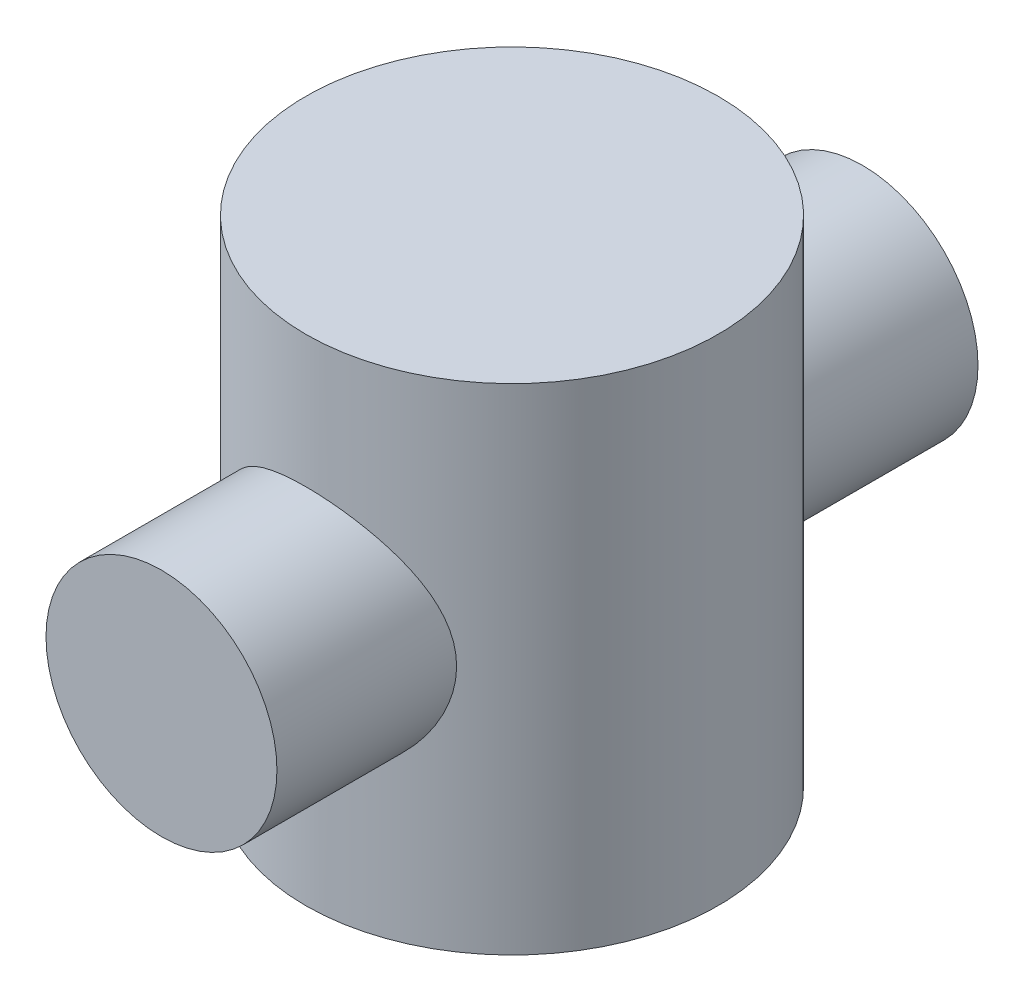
from build123d import *

# Parameters (mm, degrees)
SKETCH_1_R      = 50
EXTRUDE_1_DEPTH = 120
SKETCH_2_R      = 28
EXTRUDE_2_DEPTH = 85


with BuildPart() as part:
    # Sketch 1 → Extrude 1 (new body)
    with BuildSketch(Plane(origin=(0, 0, 0), x_dir=(1, 0, 0), z_dir=(0, 1, 0))):
        with Locations(Location((0, 0, 0), (0, 0, 270))):
            Circle(SKETCH_1_R)
    extrude(amount=EXTRUDE_1_DEPTH)

    # Sketch 2 → Extrude 2 (add, symmetric)
    with BuildSketch(Plane.XY):
        with Locations(Location((0, 60, 0), (0, 0, 180))):
            Circle(SKETCH_2_R)
    extrude(amount=EXTRUDE_2_DEPTH, both=True)


solid = part.part
